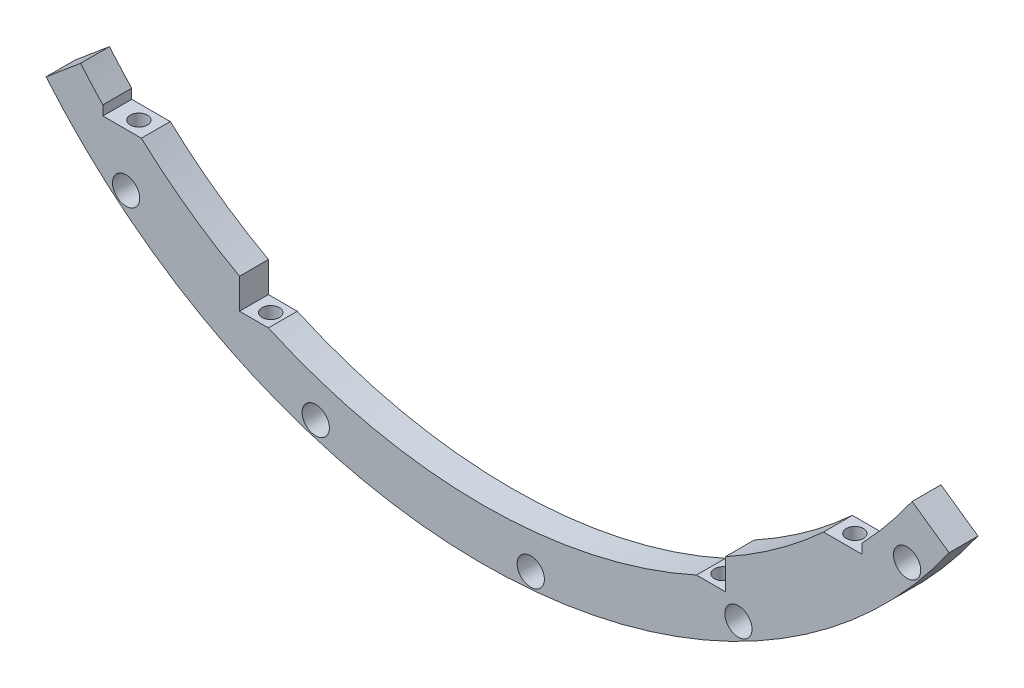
from build123d import *

# Parameters (mm, degrees)
EXTRUDE1_DEPTH                  = 4.7625
F_8_CLEARANCE_HOLE1_D           = 4.4958
F_4_40_TAPPED_HOLE1_D           = 2.8448
F_4_40_TAPPED_HOLE2_D           = 2.2606
F_4_40_TAPPED_HOLE2_DEPTH       = 8.89
F_4_40_TAPPED_HOLE2_CBORE_D     = 2.8448
F_4_40_TAPPED_HOLE2_CBORE_DEPTH = 5.588
F_4_40_TAPPED_HOLE2_TIP         = 0.679152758


with BuildPart() as part:
    # Sketch1 → Extrude1 (new body)
    with BuildSketch(Plane.XY):
        with BuildLine():
            Line((-71.992856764, -60.409179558), (-66.283337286, -55.61832387))
            ThreePointArc((-66.283337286, -55.61832387), (-64.479826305, -57.699486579), (-62.611, -59.72220216))
            Line((-62.611, -59.72220216), (-62.611, -61.30970216))
            Line((-62.611, -61.30970216), (-56.261, -61.30970216))
            ThreePointArc((-56.261, -61.30970216), (-48.513888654, -67.606081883), (-40.0685, -72.929383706))
            Line((-40.0685, -72.929383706), (-40.0685, -77.93286988))
            Line((-40.0685, -77.93286988), (-35.306, -77.93286988))
            ThreePointArc((-35.306, -77.93286988), (0, -85.557266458), (35.306, -77.93286988))
            Line((35.306, -77.93286988), (40.0685, -77.93286988))
            Line((40.0685, -77.93286988), (40.0685, -72.929383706))
            ThreePointArc((40.0685, -72.929383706), (48.513888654, -67.606081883), (56.261, -61.30970216))
            Line((56.261, -61.30970216), (62.611, -61.30970216))
            Line((62.611, -61.30970216), (62.611, -59.72220216))
            ThreePointArc((62.611, -59.72220216), (66.935272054, -54.831998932), (70.878565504, -49.629705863))
            Line((70.878565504, -49.629705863), (76.983909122, -53.904713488))
            ThreePointArc((76.983909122, -53.904713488), (4.099350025, -93.890551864), (-71.992856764, -60.409179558))
        make_face()
    extrude(amount=EXTRUDE1_DEPTH)

    # 8 Clearance Hole1 (through all)
    with Locations(Plane.XY.offset(4.7625)):
        with Locations((7.969521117, -91.092043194), (-27.496538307, -87.207877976), (-58.77649903, -70.047103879), (70.047103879, -58.77649903), (42.222293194, -81.108270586)):
            Hole(F_8_CLEARANCE_HOLE1_D / 2)

    # 4-40 Tapped Hole1 (through all)
    with Locations(Plane(origin=(37.30625, -77.93286988, 2.38125), x_dir=(1, 0, 0), z_dir=(0, 1, 0))):
        with Locations((0, 0), (-74.6125, 0)):
            Hole(F_4_40_TAPPED_HOLE1_D / 2)

    # 4-40 Tapped Hole2
    with Locations(Plane(origin=(0, -61.30970216, 0), x_dir=(-1, 0, 0), z_dir=(0, 1, 0))):
        with Locations((59.055, 2.38125), (-59.055, 2.38125)):
            CounterBoreHole(F_4_40_TAPPED_HOLE2_D / 2, F_4_40_TAPPED_HOLE2_CBORE_D / 2, F_4_40_TAPPED_HOLE2_CBORE_DEPTH, depth=F_4_40_TAPPED_HOLE2_DEPTH)
            with Locations((0, 0, -(F_4_40_TAPPED_HOLE2_DEPTH + F_4_40_TAPPED_HOLE2_TIP / 2))):  # 118° drill point
                Cone(0, F_4_40_TAPPED_HOLE2_D / 2, F_4_40_TAPPED_HOLE2_TIP, mode=Mode.SUBTRACT)


solid = part.part
